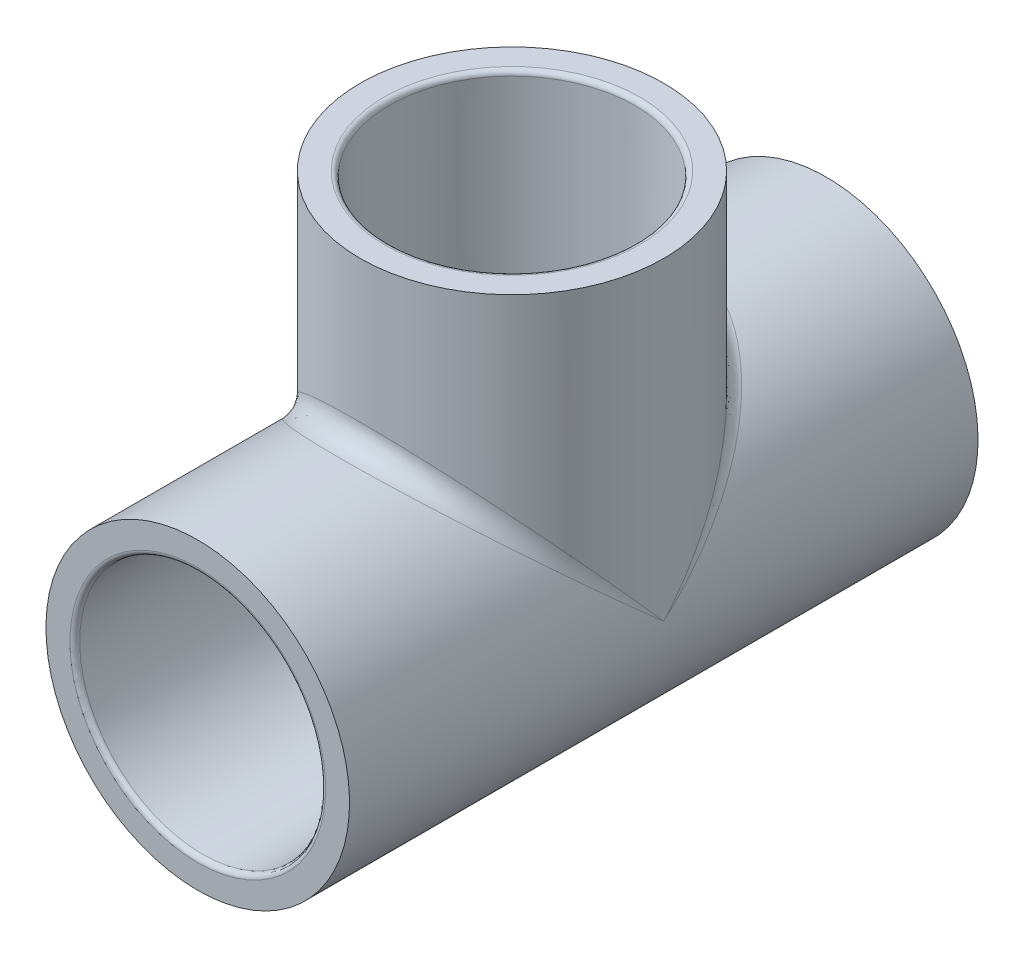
ISO-10303-21;
HEADER;
FILE_DESCRIPTION(('STEP AP214'),'2;1');
FILE_NAME('part.step','',(''),(''),'','','');
FILE_SCHEMA(('AUTOMOTIVE_DESIGN { 1 0 10303 214 1 1 1 1 }'));
ENDSEC;
DATA;
#1=APPLICATION_CONTEXT('core data for automotive mechanical design processes');
#2=APPLICATION_PROTOCOL_DEFINITION('international standard','automotive_design',2000,#1);
#3=PRODUCT_CONTEXT('',#1,'mechanical');
#4=PRODUCT('Part','Part','',(#3));
#5=PRODUCT_RELATED_PRODUCT_CATEGORY('part','',(#4));
#6=PRODUCT_DEFINITION_FORMATION('','',#4);
#7=PRODUCT_DEFINITION_CONTEXT('part definition',#1,'design');
#8=PRODUCT_DEFINITION('design','',#6,#7);
#9=PRODUCT_DEFINITION_SHAPE('','',#8);
#10=(LENGTH_UNIT() NAMED_UNIT(*) SI_UNIT(.MILLI.,.METRE.));
#11=(NAMED_UNIT(*) PLANE_ANGLE_UNIT() SI_UNIT($,.RADIAN.));
#12=(NAMED_UNIT(*) SI_UNIT($,.STERADIAN.) SOLID_ANGLE_UNIT());
#13=UNCERTAINTY_MEASURE_WITH_UNIT(LENGTH_MEASURE(1.E-05),#10,'distance_accuracy_value','');
#14=(GEOMETRIC_REPRESENTATION_CONTEXT(3) GLOBAL_UNCERTAINTY_ASSIGNED_CONTEXT((#13)) GLOBAL_UNIT_ASSIGNED_CONTEXT((#10,
#11,#12)) REPRESENTATION_CONTEXT('',''));
#15=CARTESIAN_POINT('',(0.,0.,0.));
#16=DIRECTION('',(0.,0.,1.));
#17=DIRECTION('',(1.,0.,0.));
#18=AXIS2_PLACEMENT_3D('',#15,#16,#17);
#19=CARTESIAN_POINT('',(0.,0.,34.3408));
#20=DIRECTION('',(0.,0.,1.));
#21=DIRECTION('',(0.,-1.,0.));
#22=AXIS2_PLACEMENT_3D('',#19,#20,#21);
#23=CYLINDRICAL_SURFACE('',#22,16.5862);
#24=CARTESIAN_POINT('',(0.,0.,-34.3408));
#25=DIRECTION('',(0.,0.,1.));
#26=DIRECTION('',(0.,-1.,0.));
#27=AXIS2_PLACEMENT_3D('',#24,#25,#26);
#28=CIRCLE('',#27,16.5862);
#29=CARTESIAN_POINT('',(0.,-16.5862,-34.3408));
#30=VERTEX_POINT('',#29);
#31=EDGE_CURVE('E160',#30,#30,#28,.T.);
#32=ORIENTED_EDGE('',*,*,#31,.T.);
#33=EDGE_LOOP('',(#32));
#34=FACE_BOUND('',#33,.T.);
#35=CARTESIAN_POINT('',(0.,0.,34.3408));
#36=DIRECTION('',(0.,0.,1.));
#37=DIRECTION('',(0.,-1.,0.));
#38=AXIS2_PLACEMENT_3D('',#35,#36,#37);
#39=CIRCLE('',#38,16.5862);
#40=CARTESIAN_POINT('',(0.,-16.5862,34.3408));
#41=VERTEX_POINT('',#40);
#42=EDGE_CURVE('E73',#41,#41,#39,.T.);
#43=ORIENTED_EDGE('',*,*,#42,.F.);
#44=EDGE_LOOP('',(#43));
#45=FACE_BOUND('',#44,.T.);
#46=CARTESIAN_POINT('',(0.,0.,0.));
#47=DIRECTION('',(0.,0.750538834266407,-0.660826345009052));
#48=DIRECTION('',(0.,0.660826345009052,0.750538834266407));
#49=AXIS2_PLACEMENT_3D('',#46,#47,#48);
#50=ELLIPSE('',#49,25.0991809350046,16.5862);
#51=CARTESIAN_POINT('',(16.5862,0.,0.));
#52=VERTEX_POINT('',#51);
#53=CARTESIAN_POINT('',(-16.5862,0.,0.));
#54=VERTEX_POINT('',#53);
#55=EDGE_CURVE('E116',#52,#54,#50,.F.);
#56=ORIENTED_EDGE('',*,*,#55,.T.);
#57=CARTESIAN_POINT('',(0.,0.,0.));
#58=DIRECTION('',(0.,-0.750538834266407,-0.660826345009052));
#59=DIRECTION('',(0.,-0.660826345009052,0.750538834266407));
#60=AXIS2_PLACEMENT_3D('',#57,#58,#59);
#61=ELLIPSE('',#60,25.0991809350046,16.5862);
#62=EDGE_CURVE('E119',#54,#52,#61,.T.);
#63=ORIENTED_EDGE('',*,*,#62,.T.);
#64=EDGE_LOOP('',(#56,#63));
#65=FACE_BOUND('',#64,.T.);
#66=ADVANCED_FACE('F39',(#34,#45,#65),#23,.T.);
#67=CARTESIAN_POINT('',(0.,0.,34.3408));
#68=DIRECTION('',(0.,0.,1.));
#69=DIRECTION('',(0.,-1.,0.));
#70=AXIS2_PLACEMENT_3D('',#67,#68,#69);
#71=PLANE('',#70);
#72=CARTESIAN_POINT('',(0.,0.,34.3408));
#73=DIRECTION('',(0.,0.,1.));
#74=DIRECTION('',(0.,-1.,0.));
#75=AXIS2_PLACEMENT_3D('',#72,#73,#74);
#76=CIRCLE('',#75,13.9699923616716);
#77=CARTESIAN_POINT('',(0.,-13.9699923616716,34.3408));
#78=VERTEX_POINT('',#77);
#79=EDGE_CURVE('E113',#78,#78,#76,.F.);
#80=ORIENTED_EDGE('',*,*,#79,.T.);
#81=EDGE_LOOP('',(#80));
#82=FACE_BOUND('',#81,.T.);
#83=ORIENTED_EDGE('',*,*,#42,.T.);
#84=EDGE_LOOP('',(#83));
#85=FACE_BOUND('',#84,.T.);
#86=ADVANCED_FACE('F144',(#82,#85),#71,.T.);
#87=CARTESIAN_POINT('',(0.,0.,-34.3408));
#88=DIRECTION('',(0.,0.,-1.));
#89=DIRECTION('',(0.,1.,0.));
#90=AXIS2_PLACEMENT_3D('',#87,#88,#89);
#91=PLANE('',#90);
#92=CARTESIAN_POINT('',(0.,0.,-34.3408));
#93=DIRECTION('',(0.,0.,-1.));
#94=DIRECTION('',(0.,1.,0.));
#95=AXIS2_PLACEMENT_3D('',#92,#93,#94);
#96=CIRCLE('',#95,13.9699923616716);
#97=CARTESIAN_POINT('',(0.,13.9699923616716,-34.3408));
#98=VERTEX_POINT('',#97);
#99=EDGE_CURVE('E98',#98,#98,#96,.F.);
#100=ORIENTED_EDGE('',*,*,#99,.T.);
#101=EDGE_LOOP('',(#100));
#102=FACE_BOUND('',#101,.T.);
#103=ORIENTED_EDGE('',*,*,#31,.F.);
#104=EDGE_LOOP('',(#103));
#105=FACE_BOUND('',#104,.T.);
#106=ADVANCED_FACE('F139',(#102,#105),#91,.T.);
#107=CARTESIAN_POINT('',(0.,34.3408,0.));
#108=DIRECTION('',(0.,1.,0.));
#109=DIRECTION('',(0.,0.,1.));
#110=AXIS2_PLACEMENT_3D('',#107,#108,#109);
#111=CYLINDRICAL_SURFACE('',#110,16.5862);
#112=CARTESIAN_POINT('',(0.,0.,0.));
#113=DIRECTION('',(0.,0.660826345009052,-0.750538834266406));
#114=DIRECTION('',(0.,0.750538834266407,0.660826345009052));
#115=AXIS2_PLACEMENT_3D('',#112,#113,#114);
#116=ELLIPSE('',#115,25.0991809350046,16.5862);
#117=EDGE_CURVE('E52',#54,#52,#116,.T.);
#118=ORIENTED_EDGE('',*,*,#117,.T.);
#119=CARTESIAN_POINT('',(0.,0.,0.));
#120=DIRECTION('',(0.,-0.660826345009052,-0.750538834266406));
#121=DIRECTION('',(0.,-0.750538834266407,0.660826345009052));
#122=AXIS2_PLACEMENT_3D('',#119,#120,#121);
#123=ELLIPSE('',#122,25.0991809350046,16.5862);
#124=EDGE_CURVE('E11',#52,#54,#123,.F.);
#125=ORIENTED_EDGE('',*,*,#124,.T.);
#126=EDGE_LOOP('',(#118,#125));
#127=FACE_BOUND('',#126,.T.);
#128=CARTESIAN_POINT('',(0.,34.3408,0.));
#129=DIRECTION('',(0.,1.,0.));
#130=DIRECTION('',(0.,0.,1.));
#131=AXIS2_PLACEMENT_3D('',#128,#129,#130);
#132=CIRCLE('',#131,16.5862);
#133=CARTESIAN_POINT('',(0.,34.3408,16.5862));
#134=VERTEX_POINT('',#133);
#135=EDGE_CURVE('E168',#134,#134,#132,.T.);
#136=ORIENTED_EDGE('',*,*,#135,.F.);
#137=EDGE_LOOP('',(#136));
#138=FACE_BOUND('',#137,.T.);
#139=ADVANCED_FACE('F134',(#127,#138),#111,.T.);
#140=CARTESIAN_POINT('',(0.,34.3408,0.));
#141=DIRECTION('',(0.,-1.,0.));
#142=DIRECTION('',(0.,0.,-1.));
#143=AXIS2_PLACEMENT_3D('',#140,#141,#142);
#144=PLANE('',#143);
#145=CARTESIAN_POINT('',(0.,34.3408,0.));
#146=DIRECTION('',(0.,-1.,0.));
#147=DIRECTION('',(0.,0.,-1.));
#148=AXIS2_PLACEMENT_3D('',#145,#146,#147);
#149=CIRCLE('',#148,13.9699923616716);
#150=CARTESIAN_POINT('',(0.,34.3408,-13.9699923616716));
#151=VERTEX_POINT('',#150);
#152=EDGE_CURVE('E104',#151,#151,#149,.T.);
#153=ORIENTED_EDGE('',*,*,#152,.T.);
#154=EDGE_LOOP('',(#153));
#155=FACE_BOUND('',#154,.T.);
#156=ORIENTED_EDGE('',*,*,#135,.T.);
#157=EDGE_LOOP('',(#156));
#158=FACE_BOUND('',#157,.T.);
#159=ADVANCED_FACE('F138',(#155,#158),#144,.F.);
#160=CARTESIAN_POINT('',(0.,-13.2842,14.3002));
#161=DIRECTION('',(0.,0.,-1.));
#162=DIRECTION('',(0.,1.,0.));
#163=AXIS2_PLACEMENT_3D('',#160,#161,#162);
#164=PLANE('',#163);
#165=CARTESIAN_POINT('',(0.,0.,14.3002));
#166=DIRECTION('',(0.,0.,-1.));
#167=DIRECTION('',(0.,1.,0.));
#168=AXIS2_PLACEMENT_3D('',#165,#166,#167);
#169=CIRCLE('',#168,13.0384261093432);
#170=CARTESIAN_POINT('',(0.,13.0384261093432,14.3002));
#171=VERTEX_POINT('',#170);
#172=EDGE_CURVE('E92',#171,#171,#169,.F.);
#173=ORIENTED_EDGE('',*,*,#172,.T.);
#174=EDGE_LOOP('',(#173));
#175=FACE_BOUND('',#174,.T.);
#176=CARTESIAN_POINT('',(0.,0.,14.3002));
#177=DIRECTION('',(0.,0.,1.));
#178=DIRECTION('',(0.,-1.,0.));
#179=AXIS2_PLACEMENT_3D('',#176,#177,#178);
#180=CIRCLE('',#179,12.2936);
#181=CARTESIAN_POINT('',(0.,-12.2936,14.3002));
#182=VERTEX_POINT('',#181);
#183=EDGE_CURVE('E174',#182,#182,#180,.T.);
#184=ORIENTED_EDGE('',*,*,#183,.F.);
#185=EDGE_LOOP('',(#184));
#186=FACE_BOUND('',#185,.T.);
#187=ADVANCED_FACE('F209',(#175,#186),#164,.F.);
#188=CARTESIAN_POINT('',(0.,0.,34.3408));
#189=DIRECTION('',(0.,0.,1.));
#190=DIRECTION('',(0.,-1.,0.));
#191=AXIS2_PLACEMENT_3D('',#188,#189,#190);
#192=CONICAL_SURFACE('',#191,13.4366,0.00760441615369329);
#193=CARTESIAN_POINT('',(0.,0.,33.8074230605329));
#194=DIRECTION('',(0.,0.,1.));
#195=DIRECTION('',(0.,-1.,0.));
#196=AXIS2_PLACEMENT_3D('',#193,#194,#195);
#197=CIRCLE('',#196,13.432543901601);
#198=CARTESIAN_POINT('',(0.,-13.432543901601,33.8074230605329));
#199=VERTEX_POINT('',#198);
#200=EDGE_CURVE('E110',#199,#199,#197,.T.);
#201=ORIENTED_EDGE('',*,*,#200,.T.);
#202=EDGE_LOOP('',(#201));
#203=FACE_BOUND('',#202,.T.);
#204=CARTESIAN_POINT('',(0.,0.,14.5459667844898));
#205=DIRECTION('',(0.,0.,1.));
#206=DIRECTION('',(0.,-1.,0.));
#207=AXIS2_PLACEMENT_3D('',#204,#205,#206);
#208=CIRCLE('',#207,13.2860689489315);
#209=CARTESIAN_POINT('',(0.,-13.2860689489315,14.5459667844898));
#210=VERTEX_POINT('',#209);
#211=EDGE_CURVE('E95',#210,#210,#208,.F.);
#212=ORIENTED_EDGE('',*,*,#211,.T.);
#213=EDGE_LOOP('',(#212));
#214=FACE_BOUND('',#213,.T.);
#215=ADVANCED_FACE('F206',(#203,#214),#192,.F.);
#216=CARTESIAN_POINT('',(0.,0.,-14.3002));
#217=DIRECTION('',(0.,0.,-1.));
#218=DIRECTION('',(0.,1.,0.));
#219=AXIS2_PLACEMENT_3D('',#216,#217,#218);
#220=CONICAL_SURFACE('',#219,13.2842,0.00760441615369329);
#221=CARTESIAN_POINT('',(0.,0.,-33.8074230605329));
#222=DIRECTION('',(0.,0.,-1.));
#223=DIRECTION('',(0.,1.,0.));
#224=AXIS2_PLACEMENT_3D('',#221,#222,#223);
#225=CIRCLE('',#224,13.432543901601);
#226=CARTESIAN_POINT('',(0.,13.432543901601,-33.8074230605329));
#227=VERTEX_POINT('',#226);
#228=EDGE_CURVE('E101',#227,#227,#225,.T.);
#229=ORIENTED_EDGE('',*,*,#228,.T.);
#230=EDGE_LOOP('',(#229));
#231=FACE_BOUND('',#230,.T.);
#232=CARTESIAN_POINT('',(0.,0.,-14.5459667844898));
#233=DIRECTION('',(0.,0.,-1.));
#234=DIRECTION('',(0.,1.,0.));
#235=AXIS2_PLACEMENT_3D('',#232,#233,#234);
#236=CIRCLE('',#235,13.2860689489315);
#237=CARTESIAN_POINT('',(0.,13.2860689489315,-14.5459667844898));
#238=VERTEX_POINT('',#237);
#239=EDGE_CURVE('E77',#238,#238,#236,.F.);
#240=ORIENTED_EDGE('',*,*,#239,.T.);
#241=EDGE_LOOP('',(#240));
#242=FACE_BOUND('',#241,.T.);
#243=ADVANCED_FACE('F202',(#231,#242),#220,.F.);
#244=CARTESIAN_POINT('',(0.,-13.2842,-14.3002));
#245=DIRECTION('',(0.,0.,1.));
#246=DIRECTION('',(0.,-1.,0.));
#247=AXIS2_PLACEMENT_3D('',#244,#245,#246);
#248=PLANE('',#247);
#249=CARTESIAN_POINT('',(0.,0.,-14.3002));
#250=DIRECTION('',(0.,0.,1.));
#251=DIRECTION('',(0.,-1.,0.));
#252=AXIS2_PLACEMENT_3D('',#249,#250,#251);
#253=CIRCLE('',#252,13.0384261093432);
#254=CARTESIAN_POINT('',(0.,-13.0384261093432,-14.3002));
#255=VERTEX_POINT('',#254);
#256=EDGE_CURVE('E80',#255,#255,#253,.F.);
#257=ORIENTED_EDGE('',*,*,#256,.T.);
#258=EDGE_LOOP('',(#257));
#259=FACE_BOUND('',#258,.T.);
#260=CARTESIAN_POINT('',(0.,0.,-14.3002));
#261=DIRECTION('',(0.,0.,1.));
#262=DIRECTION('',(0.,-1.,0.));
#263=AXIS2_PLACEMENT_3D('',#260,#261,#262);
#264=CIRCLE('',#263,12.2936);
#265=CARTESIAN_POINT('',(0.,-12.2936,-14.3002));
#266=VERTEX_POINT('',#265);
#267=EDGE_CURVE('E170',#266,#266,#264,.T.);
#268=ORIENTED_EDGE('',*,*,#267,.T.);
#269=EDGE_LOOP('',(#268));
#270=FACE_BOUND('',#269,.T.);
#271=ADVANCED_FACE('F196',(#259,#270),#248,.F.);
#272=CARTESIAN_POINT('',(0.,0.,34.3408));
#273=DIRECTION('',(0.,0.,1.));
#274=DIRECTION('',(0.,-1.,0.));
#275=AXIS2_PLACEMENT_3D('',#272,#273,#274);
#276=CYLINDRICAL_SURFACE('',#275,12.2936);
#277=CARTESIAN_POINT('',(0.,0.,0.));
#278=DIRECTION('',(0.,0.707106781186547,0.707106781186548));
#279=DIRECTION('',(0.,-0.707106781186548,0.707106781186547));
#280=AXIS2_PLACEMENT_3D('',#277,#278,#279);
#281=ELLIPSE('',#280,17.3857758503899,12.2936);
#282=CARTESIAN_POINT('',(12.2936,0.,0.));
#283=VERTEX_POINT('',#282);
#284=CARTESIAN_POINT('',(-12.2936,0.,0.));
#285=VERTEX_POINT('',#284);
#286=EDGE_CURVE('E70',#283,#285,#281,.T.);
#287=ORIENTED_EDGE('',*,*,#286,.T.);
#288=CARTESIAN_POINT('',(0.,0.,0.));
#289=DIRECTION('',(0.,-0.707106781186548,0.707106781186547));
#290=DIRECTION('',(0.,0.707106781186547,0.707106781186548));
#291=AXIS2_PLACEMENT_3D('',#288,#289,#290);
#292=ELLIPSE('',#291,17.3857758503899,12.2936);
#293=EDGE_CURVE('E59',#285,#283,#292,.F.);
#294=ORIENTED_EDGE('',*,*,#293,.T.);
#295=EDGE_LOOP('',(#287,#294));
#296=FACE_BOUND('',#295,.T.);
#297=ORIENTED_EDGE('',*,*,#267,.F.);
#298=EDGE_LOOP('',(#297));
#299=FACE_BOUND('',#298,.T.);
#300=ORIENTED_EDGE('',*,*,#183,.T.);
#301=EDGE_LOOP('',(#300));
#302=FACE_BOUND('',#301,.T.);
#303=ADVANCED_FACE('F75',(#296,#299,#302),#276,.F.);
#304=CARTESIAN_POINT('',(0.,0.,0.));
#305=DIRECTION('',(0.,-1.,0.));
#306=DIRECTION('',(0.,0.,-1.));
#307=AXIS2_PLACEMENT_3D('',#304,#305,#306);
#308=CYLINDRICAL_SURFACE('',#307,12.2936);
#309=CARTESIAN_POINT('',(0.,14.3002,0.));
#310=DIRECTION('',(0.,-1.,0.));
#311=DIRECTION('',(0.,0.,-1.));
#312=AXIS2_PLACEMENT_3D('',#309,#310,#311);
#313=CIRCLE('',#312,12.2936);
#314=CARTESIAN_POINT('',(0.,14.3002,-12.2936));
#315=VERTEX_POINT('',#314);
#316=EDGE_CURVE('E180',#315,#315,#313,.T.);
#317=ORIENTED_EDGE('',*,*,#316,.F.);
#318=EDGE_LOOP('',(#317));
#319=FACE_BOUND('',#318,.T.);
#320=ORIENTED_EDGE('',*,*,#286,.F.);
#321=ORIENTED_EDGE('',*,*,#293,.F.);
#322=EDGE_LOOP('',(#320,#321));
#323=FACE_BOUND('',#322,.T.);
#324=ADVANCED_FACE('F71',(#319,#323),#308,.F.);
#325=CARTESIAN_POINT('',(0.,14.3002,-12.2936));
#326=DIRECTION('',(0.,-1.,0.));
#327=DIRECTION('',(0.,0.,-1.));
#328=AXIS2_PLACEMENT_3D('',#325,#326,#327);
#329=PLANE('',#328);
#330=CARTESIAN_POINT('',(0.,14.3002,0.));
#331=DIRECTION('',(0.,-1.,0.));
#332=DIRECTION('',(0.,0.,-1.));
#333=AXIS2_PLACEMENT_3D('',#330,#331,#332);
#334=CIRCLE('',#333,13.0384261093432);
#335=CARTESIAN_POINT('',(0.,14.3002,-13.0384261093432));
#336=VERTEX_POINT('',#335);
#337=EDGE_CURVE('E89',#336,#336,#334,.F.);
#338=ORIENTED_EDGE('',*,*,#337,.T.);
#339=EDGE_LOOP('',(#338));
#340=FACE_BOUND('',#339,.T.);
#341=ORIENTED_EDGE('',*,*,#316,.T.);
#342=EDGE_LOOP('',(#341));
#343=FACE_BOUND('',#342,.T.);
#344=ADVANCED_FACE('F184',(#340,#343),#329,.F.);
#345=CARTESIAN_POINT('',(0.,14.3002,0.));
#346=DIRECTION('',(0.,1.,0.));
#347=DIRECTION('',(0.,0.,1.));
#348=AXIS2_PLACEMENT_3D('',#345,#346,#347);
#349=CONICAL_SURFACE('',#348,13.2842,0.00760441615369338);
#350=CARTESIAN_POINT('',(0.,33.8074230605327,0.));
#351=DIRECTION('',(0.,-1.,0.));
#352=DIRECTION('',(0.,0.,-1.));
#353=AXIS2_PLACEMENT_3D('',#350,#351,#352);
#354=CIRCLE('',#353,13.432543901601);
#355=CARTESIAN_POINT('',(0.,33.8074230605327,-13.432543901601));
#356=VERTEX_POINT('',#355);
#357=EDGE_CURVE('E107',#356,#356,#354,.F.);
#358=ORIENTED_EDGE('',*,*,#357,.T.);
#359=EDGE_LOOP('',(#358));
#360=FACE_BOUND('',#359,.T.);
#361=CARTESIAN_POINT('',(0.,14.5459667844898,0.));
#362=DIRECTION('',(0.,1.,0.));
#363=DIRECTION('',(0.,0.,1.));
#364=AXIS2_PLACEMENT_3D('',#361,#362,#363);
#365=CIRCLE('',#364,13.2860689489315);
#366=CARTESIAN_POINT('',(0.,14.5459667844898,13.2860689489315));
#367=VERTEX_POINT('',#366);
#368=EDGE_CURVE('E86',#367,#367,#365,.F.);
#369=ORIENTED_EDGE('',*,*,#368,.T.);
#370=EDGE_LOOP('',(#369));
#371=FACE_BOUND('',#370,.T.);
#372=ADVANCED_FACE('F193',(#360,#371),#349,.F.);
#373=CARTESIAN_POINT('',(0.,0.,-14.54785));
#374=DIRECTION('',(0.,0.,1.));
#375=DIRECTION('',(0.,-1.,0.));
#376=AXIS2_PLACEMENT_3D('',#373,#374,#375);
#377=TOROIDAL_SURFACE('',#376,13.0384261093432,0.24765);
#378=ORIENTED_EDGE('',*,*,#256,.F.);
#379=EDGE_LOOP('',(#378));
#380=FACE_BOUND('',#379,.T.);
#381=ORIENTED_EDGE('',*,*,#239,.F.);
#382=EDGE_LOOP('',(#381));
#383=FACE_BOUND('',#382,.T.);
#384=ADVANCED_FACE('F233',(#380,#383),#377,.F.);
#385=CARTESIAN_POINT('',(0.,14.54785,0.));
#386=DIRECTION('',(0.,-1.,0.));
#387=DIRECTION('',(0.,0.,-1.));
#388=AXIS2_PLACEMENT_3D('',#385,#386,#387);
#389=TOROIDAL_SURFACE('',#388,13.0384261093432,0.24765);
#390=ORIENTED_EDGE('',*,*,#337,.F.);
#391=EDGE_LOOP('',(#390));
#392=FACE_BOUND('',#391,.T.);
#393=ORIENTED_EDGE('',*,*,#368,.F.);
#394=EDGE_LOOP('',(#393));
#395=FACE_BOUND('',#394,.T.);
#396=ADVANCED_FACE('F223',(#392,#395),#389,.F.);
#397=CARTESIAN_POINT('',(0.,0.,14.54785));
#398=DIRECTION('',(0.,0.,-1.));
#399=DIRECTION('',(0.,1.,0.));
#400=AXIS2_PLACEMENT_3D('',#397,#398,#399);
#401=TOROIDAL_SURFACE('',#400,13.0384261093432,0.24765);
#402=ORIENTED_EDGE('',*,*,#211,.F.);
#403=EDGE_LOOP('',(#402));
#404=FACE_BOUND('',#403,.T.);
#405=ORIENTED_EDGE('',*,*,#172,.F.);
#406=EDGE_LOOP('',(#405));
#407=FACE_BOUND('',#406,.T.);
#408=ADVANCED_FACE('F220',(#404,#407),#401,.F.);
#409=CARTESIAN_POINT('',(0.,0.,-33.803336));
#410=DIRECTION('',(0.,0.,-1.));
#411=DIRECTION('',(0.,1.,0.));
#412=AXIS2_PLACEMENT_3D('',#409,#410,#411);
#413=TOROIDAL_SURFACE('',#412,13.9699923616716,0.537464);
#414=ORIENTED_EDGE('',*,*,#228,.F.);
#415=EDGE_LOOP('',(#414));
#416=FACE_BOUND('',#415,.T.);
#417=ORIENTED_EDGE('',*,*,#99,.F.);
#418=EDGE_LOOP('',(#417));
#419=FACE_BOUND('',#418,.T.);
#420=ADVANCED_FACE('F222',(#416,#419),#413,.T.);
#421=CARTESIAN_POINT('',(0.,33.803336,0.));
#422=DIRECTION('',(0.,-1.,0.));
#423=DIRECTION('',(0.,0.,-1.));
#424=AXIS2_PLACEMENT_3D('',#421,#422,#423);
#425=TOROIDAL_SURFACE('',#424,13.9699923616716,0.537464);
#426=ORIENTED_EDGE('',*,*,#357,.F.);
#427=EDGE_LOOP('',(#426));
#428=FACE_BOUND('',#427,.T.);
#429=ORIENTED_EDGE('',*,*,#152,.F.);
#430=EDGE_LOOP('',(#429));
#431=FACE_BOUND('',#430,.T.);
#432=ADVANCED_FACE('F230',(#428,#431),#425,.T.);
#433=CARTESIAN_POINT('',(0.,0.,33.803336));
#434=DIRECTION('',(0.,0.,1.));
#435=DIRECTION('',(0.,-1.,0.));
#436=AXIS2_PLACEMENT_3D('',#433,#434,#435);
#437=TOROIDAL_SURFACE('',#436,13.9699923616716,0.537464);
#438=ORIENTED_EDGE('',*,*,#79,.F.);
#439=EDGE_LOOP('',(#438));
#440=FACE_BOUND('',#439,.T.);
#441=ORIENTED_EDGE('',*,*,#200,.F.);
#442=EDGE_LOOP('',(#441));
#443=FACE_BOUND('',#442,.T.);
#444=ADVANCED_FACE('F128',(#440,#443),#437,.T.);
#445=CARTESIAN_POINT('',(16.5862,0.,0.));
#446=CARTESIAN_POINT('',(16.5862,0.,0.));
#447=CARTESIAN_POINT('',(16.5862,0.,0.));
#448=CARTESIAN_POINT('',(16.5861813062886,0.410375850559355,-0.36132330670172));
#449=CARTESIAN_POINT('',(16.5862468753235,0.38585335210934,-0.385853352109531));
#450=CARTESIAN_POINT('',(16.5861813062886,0.361323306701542,-0.41037585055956));
#451=CARTESIAN_POINT('',(16.5743921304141,0.820753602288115,-0.72264828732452));
#452=CARTESIAN_POINT('',(16.572786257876,0.771976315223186,-0.771976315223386));
#453=CARTESIAN_POINT('',(16.5743921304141,0.722648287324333,-0.820753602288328));
#454=CARTESIAN_POINT('',(16.5271389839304,1.64066222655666,-1.44455259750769));
#455=CARTESIAN_POINT('',(16.5190958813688,1.54256643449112,-1.54256643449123));
#456=CARTESIAN_POINT('',(16.5271389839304,1.44455259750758,-1.64066222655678));
#457=CARTESIAN_POINT('',(16.4916730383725,2.05019302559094,-1.80513186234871));
#458=CARTESIAN_POINT('',(16.4787873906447,1.92758049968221,-1.92758049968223));
#459=CARTESIAN_POINT('',(16.4916730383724,1.80513186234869,-2.05019302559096));
#460=CARTESIAN_POINT('',(16.3973361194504,2.86400624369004,-2.52166935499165));
#461=CARTESIAN_POINT('',(16.3717627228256,2.69148613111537,-2.69148613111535));
#462=CARTESIAN_POINT('',(16.3973361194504,2.52166935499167,-2.86400624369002));
#463=CARTESIAN_POINT('',(16.3386671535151,3.26830364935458,-2.87764077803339));
#464=CARTESIAN_POINT('',(16.3051227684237,3.07093967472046,-3.07093967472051));
#465=CARTESIAN_POINT('',(16.3386671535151,2.87764077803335,-3.26830364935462));
#466=CARTESIAN_POINT('',(16.1976819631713,4.07418611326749,-3.58719548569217));
#467=CARTESIAN_POINT('',(16.1453818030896,3.82583240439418,-3.82583240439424));
#468=CARTESIAN_POINT('',(16.1976819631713,3.58719548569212,-4.07418611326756));
#469=CARTESIAN_POINT('',(16.1153662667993,4.47577123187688,-3.94077882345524));
#470=CARTESIAN_POINT('',(16.0520562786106,4.2017845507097,-4.20178455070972));
#471=CARTESIAN_POINT('',(16.1153662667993,3.94077882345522,-4.4757712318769));
#472=CARTESIAN_POINT('',(15.8355981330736,5.66166418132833,-4.98492106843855));
#473=CARTESIAN_POINT('',(15.7347380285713,5.31230746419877,-5.31230746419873));
#474=CARTESIAN_POINT('',(15.8355981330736,4.98492106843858,-5.66166418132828));
#475=CARTESIAN_POINT('',(15.6037338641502,6.44096858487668,-5.67107461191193));
#476=CARTESIAN_POINT('',(15.4715150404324,6.03937197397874,-6.03937197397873));
#477=CARTESIAN_POINT('',(15.6037338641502,5.67107461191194,-6.44096858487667));
#478=CARTESIAN_POINT('',(15.0504672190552,7.95802462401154,-7.00679576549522));
#479=CARTESIAN_POINT('',(14.8496480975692,7.44292991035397,-7.44292991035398));
#480=CARTESIAN_POINT('',(15.0504672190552,7.00679576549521,-7.95802462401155));
#481=CARTESIAN_POINT('',(14.7314112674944,8.69632696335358,-7.65684825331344));
#482=CARTESIAN_POINT('',(14.4901255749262,8.12360289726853,-8.12360289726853));
#483=CARTESIAN_POINT('',(14.7314112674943,7.65684825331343,-8.69632696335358));
#484=CARTESIAN_POINT('',(14.0084223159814,10.1185817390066,-8.90909981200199));
#485=CARTESIAN_POINT('',(13.6851996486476,9.42062584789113,-9.42062584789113));
#486=CARTESIAN_POINT('',(14.0084223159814,8.90909981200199,-10.1185817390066));
#487=CARTESIAN_POINT('',(13.6075142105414,10.8035161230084,-9.51216345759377));
#488=CARTESIAN_POINT('',(13.238708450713,10.040892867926,-10.0408928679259));
#489=CARTESIAN_POINT('',(13.6075142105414,9.51216345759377,-10.8035161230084));
#490=CARTESIAN_POINT('',(12.7269715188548,12.1068316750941,-10.6596926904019));
#491=CARTESIAN_POINT('',(12.2723606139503,11.204676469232,-11.204676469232));
#492=CARTESIAN_POINT('',(12.7269715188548,10.6596926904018,-12.1068316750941));
#493=CARTESIAN_POINT('',(12.2509067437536,12.7267527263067,-11.2055140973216));
#494=CARTESIAN_POINT('',(11.7513555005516,11.7516794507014,-11.7516794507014));
#495=CARTESIAN_POINT('',(12.2509067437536,11.2055140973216,-12.7267527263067));
#496=CARTESIAN_POINT('',(11.2277900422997,13.8887838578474,-12.2286467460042));
#497=CARTESIAN_POINT('',(10.6515606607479,12.7589316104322,-12.7589316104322));
#498=CARTESIAN_POINT('',(11.2277900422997,12.2286467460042,-13.8887838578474));
#499=CARTESIAN_POINT('',(10.6846263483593,14.4330837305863,-12.7078860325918));
#500=CARTESIAN_POINT('',(10.0718422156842,13.2220243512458,-13.2220243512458));
#501=CARTESIAN_POINT('',(10.6846263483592,12.7078860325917,-14.4330837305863));
#502=CARTESIAN_POINT('',(9.53586219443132,15.4341389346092,-13.5892843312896));
#503=CARTESIAN_POINT('',(8.87240271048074,14.0551052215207,-14.0551052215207));
#504=CARTESIAN_POINT('',(9.53586219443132,13.5892843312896,-15.4341389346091));
#505=CARTESIAN_POINT('',(8.93416551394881,15.8937295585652,-13.9939397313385));
#506=CARTESIAN_POINT('',(8.25239828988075,14.4271049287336,-14.4271049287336));
#507=CARTESIAN_POINT('',(8.9341655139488,13.9939397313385,-15.8937295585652));
#508=CARTESIAN_POINT('',(7.98642557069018,16.5152105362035,-14.5411346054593));
#509=CARTESIAN_POINT('',(7.30691269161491,14.9140976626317,-14.9140976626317));
#510=CARTESIAN_POINT('',(7.98642557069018,14.5411346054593,-16.5152105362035));
#511=CARTESIAN_POINT('',(7.67074159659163,16.7073389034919,-14.7102977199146));
#512=CARTESIAN_POINT('',(6.99279440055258,15.0632780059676,-15.0632780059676));
#513=CARTESIAN_POINT('',(7.67074159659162,14.7102977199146,-16.7073389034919));
#514=CARTESIAN_POINT('',(7.0218748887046,17.0713948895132,-15.0308378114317));
#515=CARTESIAN_POINT('',(6.35481131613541,15.3420516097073,-15.3420516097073));
#516=CARTESIAN_POINT('',(7.0218748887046,15.0308378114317,-17.0713948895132));
#517=CARTESIAN_POINT('',(6.68869999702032,17.2433314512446,-15.1822226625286));
#518=CARTESIAN_POINT('',(6.03106769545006,15.4712523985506,-15.4712523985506));
#519=CARTESIAN_POINT('',(6.68869999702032,15.1822226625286,-17.2433314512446));
#520=CARTESIAN_POINT('',(6.01907582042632,17.5583550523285,-15.4595912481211));
#521=CARTESIAN_POINT('',(5.38874621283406,15.7044812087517,-15.7044812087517));
#522=CARTESIAN_POINT('',(6.01907582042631,15.4595912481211,-17.5583550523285));
#523=CARTESIAN_POINT('',(5.68325517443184,17.7023026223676,-15.5863326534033));
#524=CARTESIAN_POINT('',(5.07057449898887,15.808954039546,-15.808954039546));
#525=CARTESIAN_POINT('',(5.68325517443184,15.5863326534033,-17.7023026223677));
#526=CARTESIAN_POINT('',(4.99788145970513,17.9670360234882,-15.8194222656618));
#527=CARTESIAN_POINT('',(4.42907367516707,15.9984537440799,-15.9984537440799));
#528=CARTESIAN_POINT('',(4.99788145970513,15.8194222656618,-17.9670360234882));
#529=CARTESIAN_POINT('',(4.64833512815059,18.087833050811,-15.9257803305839));
#530=CARTESIAN_POINT('',(4.10620447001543,16.0830994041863,-16.0830994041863));
#531=CARTESIAN_POINT('',(4.64833512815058,15.9257803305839,-18.087833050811));
#532=CARTESIAN_POINT('',(3.94785779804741,18.3010057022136,-16.1134722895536));
#533=CARTESIAN_POINT('',(3.46657922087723,16.230612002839,-16.230612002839));
#534=CARTESIAN_POINT('',(3.94785779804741,16.1134722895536,-18.3010057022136));
#535=CARTESIAN_POINT('',(3.59727534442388,18.3941180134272,-16.1954548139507));
#536=CARTESIAN_POINT('',(3.15042622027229,16.2937363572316,-16.2937363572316));
#537=CARTESIAN_POINT('',(3.59727534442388,16.1954548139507,-18.3941180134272));
#538=CARTESIAN_POINT('',(2.88714617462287,18.5548753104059,-16.3369966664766));
#539=CARTESIAN_POINT('',(2.51592484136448,16.4016996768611,-16.4016996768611));
#540=CARTESIAN_POINT('',(2.88714617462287,16.3369966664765,-18.554875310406));
#541=CARTESIAN_POINT('',(2.52759986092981,18.6225214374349,-16.3965569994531));
#542=CARTESIAN_POINT('',(2.19831077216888,16.4462630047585,-16.4462630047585));
#543=CARTESIAN_POINT('',(2.5275998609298,16.3965569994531,-18.6225214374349));
#544=CARTESIAN_POINT('',(1.80818191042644,18.730092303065,-16.4912698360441));
#545=CARTESIAN_POINT('',(1.56686983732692,16.5167536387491,-16.5167536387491));
#546=CARTESIAN_POINT('',(1.80818191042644,16.4912698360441,-18.730092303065));
#547=CARTESIAN_POINT('',(1.4484112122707,18.7704511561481,-16.5268045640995));
#548=CARTESIAN_POINT('',(1.25385409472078,16.5427862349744,-16.5427862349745));
#549=CARTESIAN_POINT('',(1.4484112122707,16.5268045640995,-18.7704511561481));
#550=CARTESIAN_POINT('',(0.725760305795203,18.8243597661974,-16.5742694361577));
#551=CARTESIAN_POINT('',(0.626789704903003,16.5775583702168,-16.5775583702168));
#552=CARTESIAN_POINT('',(0.725760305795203,16.5742694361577,-18.8243597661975));
#553=CARTESIAN_POINT('',(0.362880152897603,18.83791,-16.5862));
#554=CARTESIAN_POINT('',(0.313620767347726,16.5862,-16.5862));
#555=CARTESIAN_POINT('',(0.362880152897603,16.5862,-18.83791));
#556=CARTESIAN_POINT('',(-0.362880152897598,18.83791,-16.5862));
#557=CARTESIAN_POINT('',(-0.313620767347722,16.5862,-16.5862));
#558=CARTESIAN_POINT('',(-0.362880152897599,16.5862,-18.83791));
#559=CARTESIAN_POINT('',(-0.725760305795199,18.8243597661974,-16.5742694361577));
#560=CARTESIAN_POINT('',(-0.626789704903,16.5775583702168,-16.5775583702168));
#561=CARTESIAN_POINT('',(-0.7257603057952,16.5742694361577,-18.8243597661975));
#562=CARTESIAN_POINT('',(-1.4484112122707,18.7704511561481,-16.5268045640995));
#563=CARTESIAN_POINT('',(-1.25385409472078,16.5427862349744,-16.5427862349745));
#564=CARTESIAN_POINT('',(-1.4484112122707,16.5268045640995,-18.7704511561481));
#565=CARTESIAN_POINT('',(-1.80818191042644,18.730092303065,-16.4912698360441));
#566=CARTESIAN_POINT('',(-1.56686983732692,16.5167536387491,-16.5167536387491));
#567=CARTESIAN_POINT('',(-1.80818191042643,16.4912698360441,-18.730092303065));
#568=CARTESIAN_POINT('',(-2.5275998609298,18.6225214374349,-16.3965569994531));
#569=CARTESIAN_POINT('',(-2.19831077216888,16.4462630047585,-16.4462630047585));
#570=CARTESIAN_POINT('',(-2.5275998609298,16.3965569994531,-18.6225214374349));
#571=CARTESIAN_POINT('',(-2.88714617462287,18.5548753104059,-16.3369966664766));
#572=CARTESIAN_POINT('',(-2.51592484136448,16.4016996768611,-16.4016996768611));
#573=CARTESIAN_POINT('',(-2.88714617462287,16.3369966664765,-18.554875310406));
#574=CARTESIAN_POINT('',(-3.59727534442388,18.3941180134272,-16.1954548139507));
#575=CARTESIAN_POINT('',(-3.15042622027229,16.2937363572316,-16.2937363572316));
#576=CARTESIAN_POINT('',(-3.59727534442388,16.1954548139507,-18.3941180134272));
#577=CARTESIAN_POINT('',(-3.94785779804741,18.3010057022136,-16.1134722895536));
#578=CARTESIAN_POINT('',(-3.46657922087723,16.230612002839,-16.230612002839));
#579=CARTESIAN_POINT('',(-3.9478577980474,16.1134722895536,-18.3010057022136));
#580=CARTESIAN_POINT('',(-4.64833512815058,18.087833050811,-15.9257803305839));
#581=CARTESIAN_POINT('',(-4.10620447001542,16.0830994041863,-16.0830994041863));
#582=CARTESIAN_POINT('',(-4.64833512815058,15.9257803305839,-18.087833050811));
#583=CARTESIAN_POINT('',(-4.99788145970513,17.9670360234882,-15.8194222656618));
#584=CARTESIAN_POINT('',(-4.42907367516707,15.9984537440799,-15.9984537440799));
#585=CARTESIAN_POINT('',(-4.99788145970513,15.8194222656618,-17.9670360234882));
#586=CARTESIAN_POINT('',(-5.68325517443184,17.7023026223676,-15.5863326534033));
#587=CARTESIAN_POINT('',(-5.07057449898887,15.808954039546,-15.808954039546));
#588=CARTESIAN_POINT('',(-5.68325517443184,15.5863326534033,-17.7023026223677));
#589=CARTESIAN_POINT('',(-6.01907582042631,17.5583550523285,-15.4595912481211));
#590=CARTESIAN_POINT('',(-5.38874621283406,15.7044812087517,-15.7044812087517));
#591=CARTESIAN_POINT('',(-6.01907582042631,15.4595912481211,-17.5583550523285));
#592=CARTESIAN_POINT('',(-6.68869999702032,17.2433314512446,-15.1822226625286));
#593=CARTESIAN_POINT('',(-6.03106769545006,15.4712523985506,-15.4712523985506));
#594=CARTESIAN_POINT('',(-6.68869999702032,15.1822226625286,-17.2433314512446));
#595=CARTESIAN_POINT('',(-7.0218748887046,17.0713948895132,-15.0308378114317));
#596=CARTESIAN_POINT('',(-6.35481131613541,15.3420516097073,-15.3420516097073));
#597=CARTESIAN_POINT('',(-7.0218748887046,15.0308378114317,-17.0713948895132));
#598=CARTESIAN_POINT('',(-7.67074159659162,16.7073389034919,-14.7102977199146));
#599=CARTESIAN_POINT('',(-6.99279440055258,15.0632780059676,-15.0632780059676));
#600=CARTESIAN_POINT('',(-7.67074159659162,14.7102977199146,-16.7073389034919));
#601=CARTESIAN_POINT('',(-7.98642557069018,16.5152105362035,-14.5411346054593));
#602=CARTESIAN_POINT('',(-7.30691269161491,14.9140976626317,-14.9140976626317));
#603=CARTESIAN_POINT('',(-7.98642557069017,14.5411346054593,-16.5152105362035));
#604=CARTESIAN_POINT('',(-8.9341655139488,15.8937295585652,-13.9939397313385));
#605=CARTESIAN_POINT('',(-8.25239828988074,14.4271049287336,-14.4271049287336));
#606=CARTESIAN_POINT('',(-8.93416551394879,13.9939397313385,-15.8937295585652));
#607=CARTESIAN_POINT('',(-9.53586219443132,15.4341389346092,-13.5892843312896));
#608=CARTESIAN_POINT('',(-8.87240271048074,14.0551052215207,-14.0551052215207));
#609=CARTESIAN_POINT('',(-9.53586219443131,13.5892843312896,-15.4341389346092));
#610=CARTESIAN_POINT('',(-10.6846263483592,14.4330837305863,-12.7078860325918));
#611=CARTESIAN_POINT('',(-10.0718422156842,13.2220243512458,-13.2220243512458));
#612=CARTESIAN_POINT('',(-10.6846263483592,12.7078860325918,-14.4330837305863));
#613=CARTESIAN_POINT('',(-11.2277900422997,13.8887838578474,-12.2286467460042));
#614=CARTESIAN_POINT('',(-10.6515606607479,12.7589316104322,-12.7589316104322));
#615=CARTESIAN_POINT('',(-11.2277900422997,12.2286467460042,-13.8887838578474));
#616=CARTESIAN_POINT('',(-12.2509067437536,12.7267527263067,-11.2055140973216));
#617=CARTESIAN_POINT('',(-11.7513555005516,11.7516794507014,-11.7516794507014));
#618=CARTESIAN_POINT('',(-12.2509067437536,11.2055140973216,-12.7267527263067));
#619=CARTESIAN_POINT('',(-12.7269715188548,12.1068316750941,-10.6596926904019));
#620=CARTESIAN_POINT('',(-12.2723606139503,11.204676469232,-11.204676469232));
#621=CARTESIAN_POINT('',(-12.7269715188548,10.6596926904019,-12.1068316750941));
#622=CARTESIAN_POINT('',(-13.6075142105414,10.8035161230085,-9.51216345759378));
#623=CARTESIAN_POINT('',(-13.238708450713,10.040892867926,-10.040892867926));
#624=CARTESIAN_POINT('',(-13.6075142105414,9.51216345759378,-10.8035161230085));
#625=CARTESIAN_POINT('',(-14.0084223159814,10.1185817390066,-8.909099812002));
#626=CARTESIAN_POINT('',(-13.6851996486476,9.42062584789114,-9.42062584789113));
#627=CARTESIAN_POINT('',(-14.0084223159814,8.909099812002,-10.1185817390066));
#628=CARTESIAN_POINT('',(-14.7314112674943,8.69632696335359,-7.65684825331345));
#629=CARTESIAN_POINT('',(-14.4901255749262,8.12360289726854,-8.12360289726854));
#630=CARTESIAN_POINT('',(-14.7314112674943,7.65684825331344,-8.69632696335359));
#631=CARTESIAN_POINT('',(-15.0504672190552,7.95802462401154,-7.00679576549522));
#632=CARTESIAN_POINT('',(-14.8496480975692,7.44292991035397,-7.44292991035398));
#633=CARTESIAN_POINT('',(-15.0504672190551,7.00679576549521,-7.95802462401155));
#634=CARTESIAN_POINT('',(-15.6037338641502,6.44096858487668,-5.67107461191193));
#635=CARTESIAN_POINT('',(-15.4715150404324,6.03937197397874,-6.03937197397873));
#636=CARTESIAN_POINT('',(-15.6037338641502,5.67107461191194,-6.44096858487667));
#637=CARTESIAN_POINT('',(-15.8355981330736,5.66166418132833,-4.98492106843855));
#638=CARTESIAN_POINT('',(-15.7347380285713,5.31230746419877,-5.31230746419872));
#639=CARTESIAN_POINT('',(-15.8355981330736,4.98492106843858,-5.66166418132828));
#640=CARTESIAN_POINT('',(-16.1153662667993,4.47577123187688,-3.94077882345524));
#641=CARTESIAN_POINT('',(-16.0520562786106,4.2017845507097,-4.20178455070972));
#642=CARTESIAN_POINT('',(-16.1153662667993,3.94077882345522,-4.4757712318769));
#643=CARTESIAN_POINT('',(-16.1976819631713,4.07418611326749,-3.58719548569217));
#644=CARTESIAN_POINT('',(-16.1453818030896,3.82583240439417,-3.82583240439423));
#645=CARTESIAN_POINT('',(-16.1976819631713,3.58719548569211,-4.07418611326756));
#646=CARTESIAN_POINT('',(-16.3386671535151,3.26830364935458,-2.87764077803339));
#647=CARTESIAN_POINT('',(-16.3051227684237,3.07093967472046,-3.0709396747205));
#648=CARTESIAN_POINT('',(-16.3386671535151,2.87764077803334,-3.26830364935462));
#649=CARTESIAN_POINT('',(-16.3973361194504,2.86400624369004,-2.52166935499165));
#650=CARTESIAN_POINT('',(-16.3717627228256,2.69148613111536,-2.69148613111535));
#651=CARTESIAN_POINT('',(-16.3973361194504,2.52166935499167,-2.86400624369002));
#652=CARTESIAN_POINT('',(-16.4916730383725,2.05019302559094,-1.80513186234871));
#653=CARTESIAN_POINT('',(-16.4787873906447,1.92758049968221,-1.92758049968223));
#654=CARTESIAN_POINT('',(-16.4916730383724,1.80513186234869,-2.05019302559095));
#655=CARTESIAN_POINT('',(-16.5271389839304,1.64066222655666,-1.44455259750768));
#656=CARTESIAN_POINT('',(-16.5190958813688,1.54256643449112,-1.54256643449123));
#657=CARTESIAN_POINT('',(-16.5271389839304,1.44455259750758,-1.64066222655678));
#658=CARTESIAN_POINT('',(-16.5743921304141,0.820753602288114,-0.722648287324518));
#659=CARTESIAN_POINT('',(-16.572786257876,0.771976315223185,-0.771976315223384));
#660=CARTESIAN_POINT('',(-16.5743921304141,0.722648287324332,-0.820753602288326));
#661=CARTESIAN_POINT('',(-16.5861813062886,0.410375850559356,-0.361323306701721));
#662=CARTESIAN_POINT('',(-16.5862468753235,0.385853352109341,-0.38585335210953));
#663=CARTESIAN_POINT('',(-16.5861813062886,0.361323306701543,-0.410375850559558));
#664=CARTESIAN_POINT('',(-16.5862,0.,0.));
#665=CARTESIAN_POINT('',(-16.5862,0.,0.));
#666=CARTESIAN_POINT('',(-16.5862,0.,0.));
#667=(BOUNDED_SURFACE() B_SPLINE_SURFACE(3,2,((#445,#446,#447),(#448,#449,#450),(#451,#452,
#453),(#454,#455,#456),(#457,#458,#459),(#460,#461,#462),(#463,#464,#465),(#466,#467,#468),
(#469,#470,#471),(#472,#473,#474),(#475,#476,#477),(#478,#479,#480),(#481,#482,#483),(#484,#485,
#486),(#487,#488,#489),(#490,#491,#492),(#493,#494,#495),(#496,#497,#498),(#499,#500,#501),
(#502,#503,#504),(#505,#506,#507),(#508,#509,#510),(#511,#512,#513),(#514,#515,#516),(#517,#518,
#519),(#520,#521,#522),(#523,#524,#525),(#526,#527,#528),(#529,#530,#531),(#532,#533,#534),
(#535,#536,#537),(#538,#539,#540),(#541,#542,#543),(#544,#545,#546),(#547,#548,#549),(#550,#551,
#552),(#553,#554,#555),(#556,#557,#558),(#559,#560,#561),(#562,#563,#564),(#565,#566,#567),
(#568,#569,#570),(#571,#572,#573),(#574,#575,#576),(#577,#578,#579),(#580,#581,#582),(#583,#584,
#585),(#586,#587,#588),(#589,#590,#591),(#592,#593,#594),(#595,#596,#597),(#598,#599,#600),
(#601,#602,#603),(#604,#605,#606),(#607,#608,#609),(#610,#611,#612),(#613,#614,#615),(#616,#617,
#618),(#619,#620,#621),(#622,#623,#624),(#625,#626,#627),(#628,#629,#630),(#631,#632,#633),
(#634,#635,#636),(#637,#638,#639),(#640,#641,#642),(#643,#644,#645),(#646,#647,#648),(#649,#650,
#651),(#652,#653,#654),(#655,#656,#657),(#658,#659,#660),(#661,#662,#663),(#664,#665,#666)),
.UNSPECIFIED.,.F.,.F.,.F.) B_SPLINE_SURFACE_WITH_KNOTS((4,2,2,2,2,2,2,2,2,2,2,2,2,2,2,2,2,2,2,2,
2,2,2,2,2,2,2,2,2,2,2,2,2,2,2,2,4),(3,3),(0.,1.74092484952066,3.48199493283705,5.20822949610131,
6.93442551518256,10.3280039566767,13.6379836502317,16.8426064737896,19.9254743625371,
22.8770055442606,25.6958711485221,27.0443667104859,28.3922627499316,29.6878596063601,
30.9828282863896,32.2393896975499,33.4958947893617,34.7319075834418,35.9678983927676,
37.2038892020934,38.4399019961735,39.6964070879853,40.9529684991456,42.2479371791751,
43.5435340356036,44.8914300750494,46.2399256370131,49.0587912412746,52.0103224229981,
55.0931903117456,58.2978131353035,61.6077928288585,65.0013712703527,66.7275672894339,
68.4538018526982,70.1948719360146,71.9357967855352),(0.,1.),
.UNSPECIFIED.) GEOMETRIC_REPRESENTATION_ITEM() RATIONAL_B_SPLINE_SURFACE(((1.,1.,1.),(1.,
1.00000025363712,1.),(1.,0.99964406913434,1.),(1.,0.998220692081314,1.),(1.,0.997153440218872,
1.),(1.,0.994321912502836,1.),(1.,0.992563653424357,1.),(1.,0.988355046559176,1.),(1.,
0.985904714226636,1.),(1.,0.977617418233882,1.),(1.,0.970795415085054,1.),(1.,0.954789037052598,
1.),(1.,0.945666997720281,1.),(1.,0.925488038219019,1.),(1.,0.914501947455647,1.),(1.,
0.891169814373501,1.),(1.,0.878891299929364,1.),(1.,0.853707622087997,1.),(1.,0.840851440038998,
1.),(1.,0.815385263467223,1.),(1.,0.802790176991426,1.),(1.,0.784723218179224,1.),(1.,
0.778962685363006,1.),(1.,0.767759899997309,1.),(1.,0.762317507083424,1.),(1.,0.752114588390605,
1.),(1.,0.747335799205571,1.),(1.,0.738380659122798,1.),(1.,0.73420401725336,1.),(1.,
0.72672160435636,1.),(1.,0.72339367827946,1.),(1.,0.717585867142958,1.),(1.,0.715105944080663,
1.),(1.,0.711136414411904,1.),(1.,0.70963131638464,1.),(1.,0.707616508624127,1.),(1.,
0.707106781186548,1.),(1.,0.707106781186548,1.),(1.,0.707616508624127,1.),(1.,0.70963131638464,
1.),(1.,0.711136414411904,1.),(1.,0.715105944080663,1.),(1.,0.717585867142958,1.),(1.,
0.72339367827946,1.),(1.,0.72672160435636,1.),(1.,0.73420401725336,1.),(1.,0.738380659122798,
1.),(1.,0.747335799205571,1.),(1.,0.752114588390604,1.),(1.,0.762317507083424,1.),(1.,
0.767759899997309,1.),(1.,0.778962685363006,1.),(1.,0.784723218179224,1.),(1.,0.802790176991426,
1.),(1.,0.815385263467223,1.),(1.,0.840851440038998,1.),(1.,0.853707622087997,1.),(1.,
0.878891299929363,1.),(1.,0.8911698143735,1.),(1.,0.914501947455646,1.),(1.,0.925488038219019,
1.),(1.,0.945666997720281,1.),(1.,0.954789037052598,1.),(1.,0.970795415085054,1.),(1.,
0.977617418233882,1.),(1.,0.985904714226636,1.),(1.,0.988355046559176,1.),(1.,0.992563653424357,
1.),(1.,0.994321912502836,1.),(1.,0.997153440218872,1.),(1.,0.998220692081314,1.),(1.,
0.99964406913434,1.),(1.,1.00000025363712,1.),(1.,1.,1.))) REPRESENTATION_ITEM('') SURFACE());
#668=ORIENTED_EDGE('',*,*,#62,.F.);
#669=ORIENTED_EDGE('',*,*,#124,.F.);
#670=EDGE_LOOP('',(#668,#669));
#671=FACE_BOUND('',#670,.T.);
#672=ADVANCED_FACE('F123',(#671),#667,.F.);
#673=CARTESIAN_POINT('',(16.5862,0.,0.));
#674=CARTESIAN_POINT('',(16.5862,0.,0.));
#675=CARTESIAN_POINT('',(16.5862,0.,0.));
#676=CARTESIAN_POINT('',(16.5861813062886,0.36132330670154,0.410375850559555));
#677=CARTESIAN_POINT('',(16.5862468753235,0.385853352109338,0.385853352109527));
#678=CARTESIAN_POINT('',(16.5861813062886,0.410375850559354,0.361323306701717));
#679=CARTESIAN_POINT('',(16.5743921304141,0.72264828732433,0.820753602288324));
#680=CARTESIAN_POINT('',(16.572786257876,0.771976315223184,0.771976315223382));
#681=CARTESIAN_POINT('',(16.5743921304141,0.820753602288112,0.722648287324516));
#682=CARTESIAN_POINT('',(16.5271389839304,1.44455259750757,1.64066222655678));
#683=CARTESIAN_POINT('',(16.5190958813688,1.54256643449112,1.54256643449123));
#684=CARTESIAN_POINT('',(16.5271389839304,1.64066222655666,1.44455259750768));
#685=CARTESIAN_POINT('',(16.4916730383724,1.80513186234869,2.05019302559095));
#686=CARTESIAN_POINT('',(16.4787873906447,1.92758049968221,1.92758049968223));
#687=CARTESIAN_POINT('',(16.4916730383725,2.05019302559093,1.80513186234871));
#688=CARTESIAN_POINT('',(16.3973361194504,2.52166935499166,2.86400624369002));
#689=CARTESIAN_POINT('',(16.3717627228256,2.69148613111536,2.69148613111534));
#690=CARTESIAN_POINT('',(16.3973361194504,2.86400624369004,2.52166935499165));
#691=CARTESIAN_POINT('',(16.3386671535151,2.87764077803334,3.26830364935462));
#692=CARTESIAN_POINT('',(16.3051227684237,3.07093967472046,3.0709396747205));
#693=CARTESIAN_POINT('',(16.3386671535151,3.26830364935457,2.87764077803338));
#694=CARTESIAN_POINT('',(16.1976819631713,3.58719548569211,4.07418611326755));
#695=CARTESIAN_POINT('',(16.1453818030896,3.82583240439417,3.82583240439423));
#696=CARTESIAN_POINT('',(16.1976819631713,4.07418611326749,3.58719548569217));
#697=CARTESIAN_POINT('',(16.1153662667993,3.94077882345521,4.47577123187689));
#698=CARTESIAN_POINT('',(16.0520562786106,4.2017845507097,4.20178455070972));
#699=CARTESIAN_POINT('',(16.1153662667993,4.47577123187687,3.94077882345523));
#700=CARTESIAN_POINT('',(15.8355981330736,4.98492106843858,5.66166418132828));
#701=CARTESIAN_POINT('',(15.7347380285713,5.31230746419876,5.31230746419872));
#702=CARTESIAN_POINT('',(15.8355981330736,5.66166418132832,4.98492106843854));
#703=CARTESIAN_POINT('',(15.6037338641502,5.67107461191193,6.44096858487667));
#704=CARTESIAN_POINT('',(15.4715150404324,6.03937197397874,6.03937197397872));
#705=CARTESIAN_POINT('',(15.6037338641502,6.44096858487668,5.67107461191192));
#706=CARTESIAN_POINT('',(15.0504672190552,7.00679576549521,7.95802462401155));
#707=CARTESIAN_POINT('',(14.8496480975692,7.44292991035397,7.44292991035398));
#708=CARTESIAN_POINT('',(15.0504672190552,7.95802462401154,7.00679576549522));
#709=CARTESIAN_POINT('',(14.7314112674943,7.65684825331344,8.69632696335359));
#710=CARTESIAN_POINT('',(14.4901255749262,8.12360289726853,8.12360289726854));
#711=CARTESIAN_POINT('',(14.7314112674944,8.69632696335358,7.65684825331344));
#712=CARTESIAN_POINT('',(14.0084223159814,8.90909981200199,10.1185817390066));
#713=CARTESIAN_POINT('',(13.6851996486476,9.42062584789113,9.42062584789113));
#714=CARTESIAN_POINT('',(14.0084223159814,10.1185817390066,8.909099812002));
#715=CARTESIAN_POINT('',(13.6075142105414,9.51216345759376,10.8035161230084));
#716=CARTESIAN_POINT('',(13.238708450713,10.0408928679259,10.0408928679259));
#717=CARTESIAN_POINT('',(13.6075142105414,10.8035161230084,9.51216345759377));
#718=CARTESIAN_POINT('',(12.7269715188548,10.6596926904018,12.1068316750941));
#719=CARTESIAN_POINT('',(12.2723606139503,11.204676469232,11.204676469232));
#720=CARTESIAN_POINT('',(12.7269715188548,12.1068316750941,10.6596926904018));
#721=CARTESIAN_POINT('',(12.2509067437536,11.2055140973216,12.7267527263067));
#722=CARTESIAN_POINT('',(11.7513555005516,11.7516794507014,11.7516794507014));
#723=CARTESIAN_POINT('',(12.2509067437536,12.7267527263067,11.2055140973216));
#724=CARTESIAN_POINT('',(11.2277900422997,12.2286467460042,13.8887838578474));
#725=CARTESIAN_POINT('',(10.651560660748,12.7589316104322,12.7589316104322));
#726=CARTESIAN_POINT('',(11.2277900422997,13.8887838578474,12.2286467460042));
#727=CARTESIAN_POINT('',(10.6846263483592,12.7078860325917,14.4330837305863));
#728=CARTESIAN_POINT('',(10.0718422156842,13.2220243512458,13.2220243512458));
#729=CARTESIAN_POINT('',(10.6846263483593,14.4330837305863,12.7078860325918));
#730=CARTESIAN_POINT('',(9.53586219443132,13.5892843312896,15.4341389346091));
#731=CARTESIAN_POINT('',(8.87240271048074,14.0551052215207,14.0551052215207));
#732=CARTESIAN_POINT('',(9.53586219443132,15.4341389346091,13.5892843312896));
#733=CARTESIAN_POINT('',(8.9341655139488,13.9939397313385,15.8937295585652));
#734=CARTESIAN_POINT('',(8.25239828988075,14.4271049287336,14.4271049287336));
#735=CARTESIAN_POINT('',(8.93416551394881,15.8937295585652,13.9939397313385));
#736=CARTESIAN_POINT('',(7.98642557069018,14.5411346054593,16.5152105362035));
#737=CARTESIAN_POINT('',(7.30691269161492,14.9140976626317,14.9140976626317));
#738=CARTESIAN_POINT('',(7.98642557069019,16.5152105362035,14.5411346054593));
#739=CARTESIAN_POINT('',(7.67074159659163,14.7102977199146,16.7073389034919));
#740=CARTESIAN_POINT('',(6.99279440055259,15.0632780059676,15.0632780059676));
#741=CARTESIAN_POINT('',(7.67074159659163,16.7073389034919,14.7102977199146));
#742=CARTESIAN_POINT('',(7.0218748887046,15.0308378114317,17.0713948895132));
#743=CARTESIAN_POINT('',(6.35481131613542,15.3420516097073,15.3420516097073));
#744=CARTESIAN_POINT('',(7.0218748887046,17.0713948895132,15.0308378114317));
#745=CARTESIAN_POINT('',(6.68869999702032,15.1822226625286,17.2433314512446));
#746=CARTESIAN_POINT('',(6.03106769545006,15.4712523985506,15.4712523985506));
#747=CARTESIAN_POINT('',(6.68869999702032,17.2433314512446,15.1822226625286));
#748=CARTESIAN_POINT('',(6.01907582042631,15.4595912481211,17.5583550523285));
#749=CARTESIAN_POINT('',(5.38874621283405,15.7044812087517,15.7044812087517));
#750=CARTESIAN_POINT('',(6.01907582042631,17.5583550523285,15.4595912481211));
#751=CARTESIAN_POINT('',(5.68325517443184,15.5863326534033,17.7023026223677));
#752=CARTESIAN_POINT('',(5.07057449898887,15.808954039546,15.808954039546));
#753=CARTESIAN_POINT('',(5.68325517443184,17.7023026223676,15.5863326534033));
#754=CARTESIAN_POINT('',(4.99788145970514,15.8194222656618,17.9670360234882));
#755=CARTESIAN_POINT('',(4.42907367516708,15.9984537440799,15.9984537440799));
#756=CARTESIAN_POINT('',(4.99788145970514,17.9670360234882,15.8194222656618));
#757=CARTESIAN_POINT('',(4.64833512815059,15.9257803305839,18.087833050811));
#758=CARTESIAN_POINT('',(4.10620447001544,16.0830994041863,16.0830994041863));
#759=CARTESIAN_POINT('',(4.64833512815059,18.087833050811,15.9257803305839));
#760=CARTESIAN_POINT('',(3.94785779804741,16.1134722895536,18.3010057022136));
#761=CARTESIAN_POINT('',(3.46657922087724,16.230612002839,16.230612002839));
#762=CARTESIAN_POINT('',(3.94785779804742,18.3010057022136,16.1134722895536));
#763=CARTESIAN_POINT('',(3.59727534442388,16.1954548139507,18.3941180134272));
#764=CARTESIAN_POINT('',(3.15042622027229,16.2937363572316,16.2937363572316));
#765=CARTESIAN_POINT('',(3.59727534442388,18.3941180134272,16.1954548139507));
#766=CARTESIAN_POINT('',(2.88714617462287,16.3369966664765,18.554875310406));
#767=CARTESIAN_POINT('',(2.51592484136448,16.4016996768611,16.4016996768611));
#768=CARTESIAN_POINT('',(2.88714617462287,18.5548753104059,16.3369966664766));
#769=CARTESIAN_POINT('',(2.5275998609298,16.3965569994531,18.6225214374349));
#770=CARTESIAN_POINT('',(2.19831077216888,16.4462630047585,16.4462630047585));
#771=CARTESIAN_POINT('',(2.5275998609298,18.6225214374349,16.3965569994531));
#772=CARTESIAN_POINT('',(1.80818191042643,16.4912698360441,18.730092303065));
#773=CARTESIAN_POINT('',(1.56686983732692,16.5167536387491,16.5167536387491));
#774=CARTESIAN_POINT('',(1.80818191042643,18.730092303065,16.4912698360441));
#775=CARTESIAN_POINT('',(1.4484112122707,16.5268045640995,18.7704511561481));
#776=CARTESIAN_POINT('',(1.25385409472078,16.5427862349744,16.5427862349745));
#777=CARTESIAN_POINT('',(1.4484112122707,18.7704511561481,16.5268045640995));
#778=CARTESIAN_POINT('',(0.725760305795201,16.5742694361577,18.8243597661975));
#779=CARTESIAN_POINT('',(0.626789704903,16.5775583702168,16.5775583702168));
#780=CARTESIAN_POINT('',(0.7257603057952,18.8243597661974,16.5742694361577));
#781=CARTESIAN_POINT('',(0.362880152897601,16.5862,18.83791));
#782=CARTESIAN_POINT('',(0.313620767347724,16.5862,16.5862));
#783=CARTESIAN_POINT('',(0.3628801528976,18.83791,16.5862));
#784=CARTESIAN_POINT('',(-0.362880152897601,16.5862,18.83791));
#785=CARTESIAN_POINT('',(-0.313620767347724,16.5862,16.5862));
#786=CARTESIAN_POINT('',(-0.3628801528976,18.83791,16.5862));
#787=CARTESIAN_POINT('',(-0.725760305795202,16.5742694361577,18.8243597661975));
#788=CARTESIAN_POINT('',(-0.626789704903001,16.5775583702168,16.5775583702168));
#789=CARTESIAN_POINT('',(-0.725760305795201,18.8243597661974,16.5742694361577));
#790=CARTESIAN_POINT('',(-1.4484112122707,16.5268045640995,18.7704511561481));
#791=CARTESIAN_POINT('',(-1.25385409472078,16.5427862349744,16.5427862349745));
#792=CARTESIAN_POINT('',(-1.4484112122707,18.7704511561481,16.5268045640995));
#793=CARTESIAN_POINT('',(-1.80818191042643,16.4912698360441,18.730092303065));
#794=CARTESIAN_POINT('',(-1.56686983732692,16.5167536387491,16.5167536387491));
#795=CARTESIAN_POINT('',(-1.80818191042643,18.730092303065,16.4912698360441));
#796=CARTESIAN_POINT('',(-2.5275998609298,16.3965569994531,18.6225214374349));
#797=CARTESIAN_POINT('',(-2.19831077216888,16.4462630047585,16.4462630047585));
#798=CARTESIAN_POINT('',(-2.5275998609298,18.6225214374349,16.3965569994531));
#799=CARTESIAN_POINT('',(-2.88714617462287,16.3369966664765,18.554875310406));
#800=CARTESIAN_POINT('',(-2.51592484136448,16.4016996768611,16.4016996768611));
#801=CARTESIAN_POINT('',(-2.88714617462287,18.5548753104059,16.3369966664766));
#802=CARTESIAN_POINT('',(-3.59727534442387,16.1954548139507,18.3941180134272));
#803=CARTESIAN_POINT('',(-3.15042622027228,16.2937363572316,16.2937363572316));
#804=CARTESIAN_POINT('',(-3.59727534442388,18.3941180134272,16.1954548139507));
#805=CARTESIAN_POINT('',(-3.9478577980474,16.1134722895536,18.3010057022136));
#806=CARTESIAN_POINT('',(-3.46657922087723,16.230612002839,16.230612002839));
#807=CARTESIAN_POINT('',(-3.9478577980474,18.3010057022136,16.1134722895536));
#808=CARTESIAN_POINT('',(-4.64833512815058,15.9257803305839,18.087833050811));
#809=CARTESIAN_POINT('',(-4.10620447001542,16.0830994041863,16.0830994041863));
#810=CARTESIAN_POINT('',(-4.64833512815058,18.087833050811,15.9257803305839));
#811=CARTESIAN_POINT('',(-4.99788145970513,15.8194222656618,17.9670360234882));
#812=CARTESIAN_POINT('',(-4.42907367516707,15.9984537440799,15.9984537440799));
#813=CARTESIAN_POINT('',(-4.99788145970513,17.9670360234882,15.8194222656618));
#814=CARTESIAN_POINT('',(-5.68325517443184,15.5863326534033,17.7023026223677));
#815=CARTESIAN_POINT('',(-5.07057449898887,15.808954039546,15.808954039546));
#816=CARTESIAN_POINT('',(-5.68325517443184,17.7023026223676,15.5863326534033));
#817=CARTESIAN_POINT('',(-6.01907582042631,15.4595912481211,17.5583550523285));
#818=CARTESIAN_POINT('',(-5.38874621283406,15.7044812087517,15.7044812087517));
#819=CARTESIAN_POINT('',(-6.01907582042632,17.5583550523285,15.4595912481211));
#820=CARTESIAN_POINT('',(-6.68869999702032,15.1822226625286,17.2433314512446));
#821=CARTESIAN_POINT('',(-6.03106769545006,15.4712523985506,15.4712523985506));
#822=CARTESIAN_POINT('',(-6.68869999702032,17.2433314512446,15.1822226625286));
#823=CARTESIAN_POINT('',(-7.0218748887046,15.0308378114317,17.0713948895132));
#824=CARTESIAN_POINT('',(-6.35481131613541,15.3420516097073,15.3420516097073));
#825=CARTESIAN_POINT('',(-7.0218748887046,17.0713948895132,15.0308378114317));
#826=CARTESIAN_POINT('',(-7.67074159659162,14.7102977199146,16.7073389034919));
#827=CARTESIAN_POINT('',(-6.99279440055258,15.0632780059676,15.0632780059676));
#828=CARTESIAN_POINT('',(-7.67074159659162,16.7073389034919,14.7102977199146));
#829=CARTESIAN_POINT('',(-7.98642557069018,14.5411346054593,16.5152105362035));
#830=CARTESIAN_POINT('',(-7.30691269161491,14.9140976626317,14.9140976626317));
#831=CARTESIAN_POINT('',(-7.98642557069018,16.5152105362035,14.5411346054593));
#832=CARTESIAN_POINT('',(-8.93416551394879,13.9939397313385,15.8937295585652));
#833=CARTESIAN_POINT('',(-8.25239828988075,14.4271049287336,14.4271049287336));
#834=CARTESIAN_POINT('',(-8.9341655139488,15.8937295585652,13.9939397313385));
#835=CARTESIAN_POINT('',(-9.53586219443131,13.5892843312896,15.4341389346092));
#836=CARTESIAN_POINT('',(-8.87240271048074,14.0551052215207,14.0551052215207));
#837=CARTESIAN_POINT('',(-9.53586219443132,15.4341389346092,13.5892843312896));
#838=CARTESIAN_POINT('',(-10.6846263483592,12.7078860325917,14.4330837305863));
#839=CARTESIAN_POINT('',(-10.0718422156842,13.2220243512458,13.2220243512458));
#840=CARTESIAN_POINT('',(-10.6846263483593,14.4330837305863,12.7078860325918));
#841=CARTESIAN_POINT('',(-11.2277900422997,12.2286467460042,13.8887838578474));
#842=CARTESIAN_POINT('',(-10.6515606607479,12.7589316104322,12.7589316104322));
#843=CARTESIAN_POINT('',(-11.2277900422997,13.8887838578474,12.2286467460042));
#844=CARTESIAN_POINT('',(-12.2509067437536,11.2055140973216,12.7267527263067));
#845=CARTESIAN_POINT('',(-11.7513555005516,11.7516794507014,11.7516794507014));
#846=CARTESIAN_POINT('',(-12.2509067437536,12.7267527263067,11.2055140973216));
#847=CARTESIAN_POINT('',(-12.7269715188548,10.6596926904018,12.1068316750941));
#848=CARTESIAN_POINT('',(-12.2723606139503,11.204676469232,11.204676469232));
#849=CARTESIAN_POINT('',(-12.7269715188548,12.1068316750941,10.6596926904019));
#850=CARTESIAN_POINT('',(-13.6075142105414,9.51216345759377,10.8035161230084));
#851=CARTESIAN_POINT('',(-13.238708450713,10.040892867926,10.0408928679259));
#852=CARTESIAN_POINT('',(-13.6075142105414,10.8035161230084,9.51216345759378));
#853=CARTESIAN_POINT('',(-14.0084223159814,8.909099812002,10.1185817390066));
#854=CARTESIAN_POINT('',(-13.6851996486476,9.42062584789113,9.42062584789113));
#855=CARTESIAN_POINT('',(-14.0084223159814,10.1185817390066,8.909099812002));
#856=CARTESIAN_POINT('',(-14.7314112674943,7.65684825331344,8.69632696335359));
#857=CARTESIAN_POINT('',(-14.4901255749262,8.12360289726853,8.12360289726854));
#858=CARTESIAN_POINT('',(-14.7314112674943,8.69632696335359,7.65684825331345));
#859=CARTESIAN_POINT('',(-15.0504672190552,7.00679576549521,7.95802462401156));
#860=CARTESIAN_POINT('',(-14.8496480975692,7.44292991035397,7.44292991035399));
#861=CARTESIAN_POINT('',(-15.0504672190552,7.95802462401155,7.00679576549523));
#862=CARTESIAN_POINT('',(-15.6037338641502,5.67107461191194,6.44096858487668));
#863=CARTESIAN_POINT('',(-15.4715150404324,6.03937197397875,6.03937197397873));
#864=CARTESIAN_POINT('',(-15.6037338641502,6.44096858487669,5.67107461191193));
#865=CARTESIAN_POINT('',(-15.8355981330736,4.98492106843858,5.66166418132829));
#866=CARTESIAN_POINT('',(-15.7347380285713,5.31230746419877,5.31230746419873));
#867=CARTESIAN_POINT('',(-15.8355981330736,5.66166418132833,4.98492106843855));
#868=CARTESIAN_POINT('',(-16.1153662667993,3.94077882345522,4.4757712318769));
#869=CARTESIAN_POINT('',(-16.0520562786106,4.2017845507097,4.20178455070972));
#870=CARTESIAN_POINT('',(-16.1153662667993,4.47577123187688,3.94077882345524));
#871=CARTESIAN_POINT('',(-16.1976819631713,3.58719548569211,4.07418611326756));
#872=CARTESIAN_POINT('',(-16.1453818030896,3.82583240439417,3.82583240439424));
#873=CARTESIAN_POINT('',(-16.1976819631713,4.07418611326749,3.58719548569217));
#874=CARTESIAN_POINT('',(-16.3386671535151,2.87764077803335,3.26830364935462));
#875=CARTESIAN_POINT('',(-16.3051227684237,3.07093967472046,3.07093967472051));
#876=CARTESIAN_POINT('',(-16.3386671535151,3.26830364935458,2.87764077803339));
#877=CARTESIAN_POINT('',(-16.3973361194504,2.52166935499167,2.86400624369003));
#878=CARTESIAN_POINT('',(-16.3717627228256,2.69148613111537,2.69148613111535));
#879=CARTESIAN_POINT('',(-16.3973361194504,2.86400624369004,2.52166935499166));
#880=CARTESIAN_POINT('',(-16.4916730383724,1.80513186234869,2.05019302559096));
#881=CARTESIAN_POINT('',(-16.4787873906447,1.92758049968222,1.92758049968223));
#882=CARTESIAN_POINT('',(-16.4916730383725,2.05019302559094,1.80513186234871));
#883=CARTESIAN_POINT('',(-16.5271389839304,1.44455259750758,1.64066222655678));
#884=CARTESIAN_POINT('',(-16.5190958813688,1.54256643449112,1.54256643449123));
#885=CARTESIAN_POINT('',(-16.5271389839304,1.64066222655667,1.44455259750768));
#886=CARTESIAN_POINT('',(-16.5743921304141,0.722648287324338,0.820753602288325));
#887=CARTESIAN_POINT('',(-16.572786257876,0.771976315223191,0.771976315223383));
#888=CARTESIAN_POINT('',(-16.5743921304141,0.820753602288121,0.722648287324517));
#889=CARTESIAN_POINT('',(-16.5861813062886,0.361323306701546,0.410375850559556));
#890=CARTESIAN_POINT('',(-16.5862468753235,0.385853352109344,0.385853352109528));
#891=CARTESIAN_POINT('',(-16.5861813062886,0.41037585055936,0.361323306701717));
#892=CARTESIAN_POINT('',(-16.5862,0.,0.));
#893=CARTESIAN_POINT('',(-16.5862,0.,0.));
#894=CARTESIAN_POINT('',(-16.5862,0.,0.));
#895=(BOUNDED_SURFACE() B_SPLINE_SURFACE(3,2,((#673,#674,#675),(#676,#677,#678),(#679,#680,
#681),(#682,#683,#684),(#685,#686,#687),(#688,#689,#690),(#691,#692,#693),(#694,#695,#696),
(#697,#698,#699),(#700,#701,#702),(#703,#704,#705),(#706,#707,#708),(#709,#710,#711),(#712,#713,
#714),(#715,#716,#717),(#718,#719,#720),(#721,#722,#723),(#724,#725,#726),(#727,#728,#729),
(#730,#731,#732),(#733,#734,#735),(#736,#737,#738),(#739,#740,#741),(#742,#743,#744),(#745,#746,
#747),(#748,#749,#750),(#751,#752,#753),(#754,#755,#756),(#757,#758,#759),(#760,#761,#762),
(#763,#764,#765),(#766,#767,#768),(#769,#770,#771),(#772,#773,#774),(#775,#776,#777),(#778,#779,
#780),(#781,#782,#783),(#784,#785,#786),(#787,#788,#789),(#790,#791,#792),(#793,#794,#795),
(#796,#797,#798),(#799,#800,#801),(#802,#803,#804),(#805,#806,#807),(#808,#809,#810),(#811,#812,
#813),(#814,#815,#816),(#817,#818,#819),(#820,#821,#822),(#823,#824,#825),(#826,#827,#828),
(#829,#830,#831),(#832,#833,#834),(#835,#836,#837),(#838,#839,#840),(#841,#842,#843),(#844,#845,
#846),(#847,#848,#849),(#850,#851,#852),(#853,#854,#855),(#856,#857,#858),(#859,#860,#861),
(#862,#863,#864),(#865,#866,#867),(#868,#869,#870),(#871,#872,#873),(#874,#875,#876),(#877,#878,
#879),(#880,#881,#882),(#883,#884,#885),(#886,#887,#888),(#889,#890,#891),(#892,#893,#894)),
.UNSPECIFIED.,.F.,.F.,.F.) B_SPLINE_SURFACE_WITH_KNOTS((4,2,2,2,2,2,2,2,2,2,2,2,2,2,2,2,2,2,2,2,
2,2,2,2,2,2,2,2,2,2,2,2,2,2,2,2,4),(3,3),(0.,1.74092484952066,3.48199493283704,5.20822949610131,
6.93442551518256,10.3280039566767,13.6379836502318,16.8426064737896,19.9254743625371,
22.8770055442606,25.6958711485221,27.0443667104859,28.3922627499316,29.6878596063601,
30.9828282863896,32.2393896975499,33.4958947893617,34.7319075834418,35.9678983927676,
37.2038892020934,38.4399019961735,39.6964070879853,40.9529684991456,42.2479371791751,
43.5435340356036,44.8914300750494,46.2399256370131,49.0587912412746,52.0103224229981,
55.0931903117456,58.2978131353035,61.6077928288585,65.0013712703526,66.7275672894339,
68.4538018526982,70.1948719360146,71.9357967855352),(0.,1.),
.UNSPECIFIED.) GEOMETRIC_REPRESENTATION_ITEM() RATIONAL_B_SPLINE_SURFACE(((1.,1.,1.),(1.,
1.00000025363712,1.),(1.,0.99964406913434,1.),(1.,0.998220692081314,1.),(1.,0.997153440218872,
1.),(1.,0.994321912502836,1.),(1.,0.992563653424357,1.),(1.,0.988355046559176,1.),(1.,
0.985904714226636,1.),(1.,0.977617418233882,1.),(1.,0.970795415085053,1.),(1.,0.954789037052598,
1.),(1.,0.945666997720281,1.),(1.,0.92548803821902,1.),(1.,0.914501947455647,1.),(1.,
0.891169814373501,1.),(1.,0.878891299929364,1.),(1.,0.853707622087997,1.),(1.,0.840851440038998,
1.),(1.,0.815385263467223,1.),(1.,0.802790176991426,1.),(1.,0.784723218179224,1.),(1.,
0.778962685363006,1.),(1.,0.767759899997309,1.),(1.,0.762317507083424,1.),(1.,0.752114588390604,
1.),(1.,0.747335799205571,1.),(1.,0.738380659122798,1.),(1.,0.73420401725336,1.),(1.,
0.72672160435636,1.),(1.,0.72339367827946,1.),(1.,0.717585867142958,1.),(1.,0.715105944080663,
1.),(1.,0.711136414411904,1.),(1.,0.70963131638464,1.),(1.,0.707616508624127,1.),(1.,
0.707106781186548,1.),(1.,0.707106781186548,1.),(1.,0.707616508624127,1.),(1.,0.70963131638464,
1.),(1.,0.711136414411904,1.),(1.,0.715105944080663,1.),(1.,0.717585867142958,1.),(1.,
0.72339367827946,1.),(1.,0.72672160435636,1.),(1.,0.73420401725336,1.),(1.,0.738380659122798,
1.),(1.,0.747335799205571,1.),(1.,0.752114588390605,1.),(1.,0.762317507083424,1.),(1.,
0.767759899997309,1.),(1.,0.778962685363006,1.),(1.,0.784723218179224,1.),(1.,0.802790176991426,
1.),(1.,0.815385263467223,1.),(1.,0.840851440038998,1.),(1.,0.853707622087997,1.),(1.,
0.878891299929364,1.),(1.,0.891169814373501,1.),(1.,0.914501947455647,1.),(1.,0.92548803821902,
1.),(1.,0.945666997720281,1.),(1.,0.954789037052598,1.),(1.,0.970795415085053,1.),(1.,
0.977617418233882,1.),(1.,0.985904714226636,1.),(1.,0.988355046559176,1.),(1.,0.992563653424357,
1.),(1.,0.994321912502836,1.),(1.,0.997153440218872,1.),(1.,0.998220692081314,1.),(1.,
0.99964406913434,1.),(1.,1.00000025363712,1.),(1.,1.,1.))) REPRESENTATION_ITEM('') SURFACE());
#896=ORIENTED_EDGE('',*,*,#55,.F.);
#897=ORIENTED_EDGE('',*,*,#117,.F.);
#898=EDGE_LOOP('',(#896,#897));
#899=FACE_BOUND('',#898,.T.);
#900=ADVANCED_FACE('F41',(#899),#895,.F.);
#901=CLOSED_SHELL('',(#66,#86,#106,#139,#159,#187,#215,#243,#271,#303,#324,#344,#372,#384,#396,
#408,#420,#432,#444,#672,#900));
#902=MANIFOLD_SOLID_BREP('B2',#901);
#903=ADVANCED_BREP_SHAPE_REPRESENTATION('',(#18,#902),#14);
#904=SHAPE_DEFINITION_REPRESENTATION(#9,#903);
ENDSEC;
END-ISO-10303-21;
